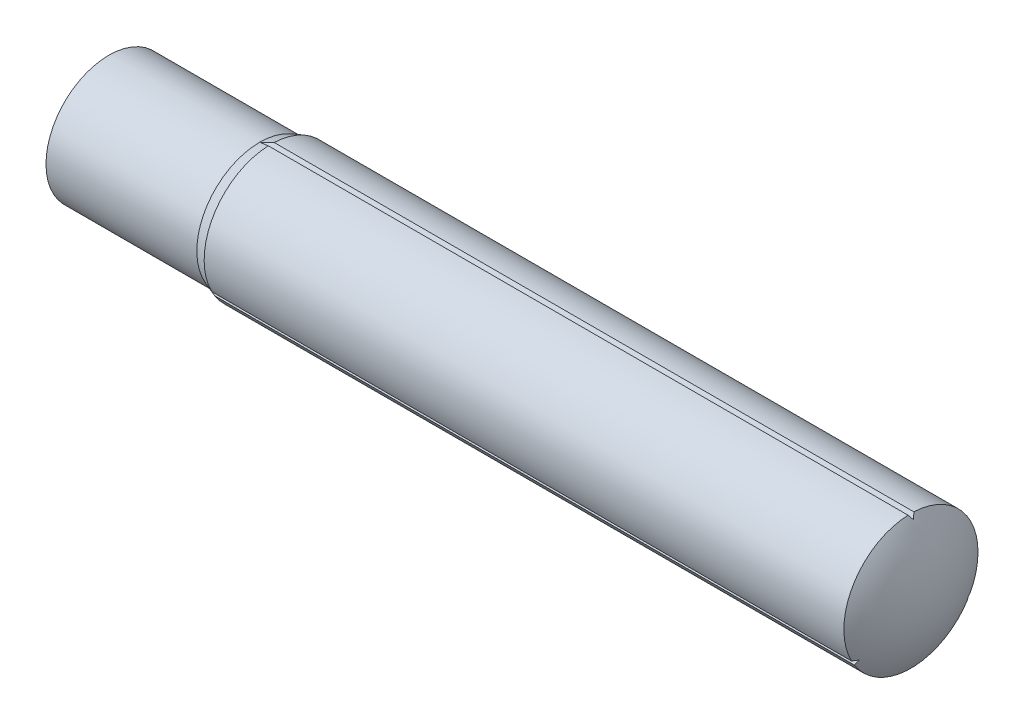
ISO-10303-21;
HEADER;
FILE_DESCRIPTION(('STEP AP214'),'2;1');
FILE_NAME('part.step','',(''),(''),'','','');
FILE_SCHEMA(('AUTOMOTIVE_DESIGN { 1 0 10303 214 1 1 1 1 }'));
ENDSEC;
DATA;
#1=APPLICATION_CONTEXT('core data for automotive mechanical design processes');
#2=APPLICATION_PROTOCOL_DEFINITION('international standard','automotive_design',2000,#1);
#3=PRODUCT_CONTEXT('',#1,'mechanical');
#4=PRODUCT('Part','Part','',(#3));
#5=PRODUCT_RELATED_PRODUCT_CATEGORY('part','',(#4));
#6=PRODUCT_DEFINITION_FORMATION('','',#4);
#7=PRODUCT_DEFINITION_CONTEXT('part definition',#1,'design');
#8=PRODUCT_DEFINITION('design','',#6,#7);
#9=PRODUCT_DEFINITION_SHAPE('','',#8);
#10=(LENGTH_UNIT() NAMED_UNIT(*) SI_UNIT(.MILLI.,.METRE.));
#11=(NAMED_UNIT(*) PLANE_ANGLE_UNIT() SI_UNIT($,.RADIAN.));
#12=(NAMED_UNIT(*) SI_UNIT($,.STERADIAN.) SOLID_ANGLE_UNIT());
#13=UNCERTAINTY_MEASURE_WITH_UNIT(LENGTH_MEASURE(1.E-05),#10,'distance_accuracy_value','');
#14=(GEOMETRIC_REPRESENTATION_CONTEXT(3) GLOBAL_UNCERTAINTY_ASSIGNED_CONTEXT((#13)) GLOBAL_UNIT_ASSIGNED_CONTEXT((#10,
#11,#12)) REPRESENTATION_CONTEXT('',''));
#15=CARTESIAN_POINT('',(0.,0.,0.));
#16=DIRECTION('',(0.,0.,1.));
#17=DIRECTION('',(1.,0.,0.));
#18=AXIS2_PLACEMENT_3D('',#15,#16,#17);
#19=CARTESIAN_POINT('',(8.5,0.,0.));
#20=DIRECTION('',(-1.,0.,0.));
#21=DIRECTION('',(0.,1.,0.));
#22=AXIS2_PLACEMENT_3D('',#19,#20,#21);
#23=SPHERICAL_SURFACE('',#22,1.5);
#24=CARTESIAN_POINT('',(8.5,-0.428545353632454,-0.0374928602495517));
#25=DIRECTION('',(0.,-0.996194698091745,-0.0871557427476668));
#26=DIRECTION('',(0.,0.0871557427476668,-0.996194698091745));
#27=AXIS2_PLACEMENT_3D('',#24,#25,#26);
#28=CIRCLE('',#27,1.43699101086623);
#29=CARTESIAN_POINT('',(9.76885775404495,-0.369759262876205,-0.709420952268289));
#30=VERTEX_POINT('',#29);
#31=CARTESIAN_POINT('',(9.79903810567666,-0.374999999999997,-0.649519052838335));
#32=VERTEX_POINT('',#31);
#33=EDGE_CURVE('E104',#30,#32,#28,.T.);
#34=ORIENTED_EDGE('',*,*,#33,.F.);
#35=CARTESIAN_POINT('',(9.76885775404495,0.,0.));
#36=DIRECTION('',(-1.,0.,0.));
#37=DIRECTION('',(0.,0.,1.));
#38=AXIS2_PLACEMENT_3D('',#35,#36,#37);
#39=CIRCLE('',#38,0.800000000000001);
#40=CARTESIAN_POINT('',(9.76885775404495,0.799256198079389,-0.0344895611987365));
#41=VERTEX_POINT('',#40);
#42=EDGE_CURVE('E206',#41,#30,#39,.T.);
#43=ORIENTED_EDGE('',*,*,#42,.F.);
#44=CARTESIAN_POINT('',(8.5,0.246742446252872,0.352384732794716));
#45=DIRECTION('',(0.,0.573576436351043,0.819152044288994));
#46=DIRECTION('',(0.,-0.819152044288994,0.573576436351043));
#47=AXIS2_PLACEMENT_3D('',#44,#45,#46);
#48=CIRCLE('',#47,1.43699101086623);
#49=CARTESIAN_POINT('',(9.79903810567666,0.750000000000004,0.));
#50=VERTEX_POINT('',#49);
#51=EDGE_CURVE('E184',#50,#41,#48,.T.);
#52=ORIENTED_EDGE('',*,*,#51,.F.);
#53=CARTESIAN_POINT('',(8.5,0.246742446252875,-0.352384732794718));
#54=DIRECTION('',(0.,0.573576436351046,-0.819152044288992));
#55=DIRECTION('',(0.,0.819152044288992,0.573576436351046));
#56=AXIS2_PLACEMENT_3D('',#53,#54,#55);
#57=CIRCLE('',#56,1.43699101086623);
#58=CARTESIAN_POINT('',(9.76885775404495,0.799256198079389,0.0344895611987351));
#59=VERTEX_POINT('',#58);
#60=EDGE_CURVE('E203',#59,#50,#57,.T.);
#61=ORIENTED_EDGE('',*,*,#60,.F.);
#62=CARTESIAN_POINT('',(9.76885775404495,-0.369759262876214,0.709420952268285));
#63=VERTEX_POINT('',#62);
#64=EDGE_CURVE('E205',#63,#59,#39,.T.);
#65=ORIENTED_EDGE('',*,*,#64,.F.);
#66=CARTESIAN_POINT('',(8.5,-0.428545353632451,0.0374928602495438));
#67=DIRECTION('',(0.,-0.996194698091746,0.0871557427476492));
#68=DIRECTION('',(0.,-0.0871557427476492,-0.996194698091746));
#69=AXIS2_PLACEMENT_3D('',#66,#67,#68);
#70=CIRCLE('',#69,1.43699101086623);
#71=CARTESIAN_POINT('',(9.79903810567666,-0.375000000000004,0.649519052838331));
#72=VERTEX_POINT('',#71);
#73=EDGE_CURVE('E54',#72,#63,#70,.T.);
#74=ORIENTED_EDGE('',*,*,#73,.F.);
#75=CARTESIAN_POINT('',(8.5,0.181802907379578,0.389877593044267));
#76=DIRECTION('',(0.,0.422618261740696,0.906307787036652));
#77=DIRECTION('',(0.,-0.906307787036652,0.422618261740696));
#78=AXIS2_PLACEMENT_3D('',#75,#76,#77);
#79=CIRCLE('',#78,1.43699101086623);
#80=CARTESIAN_POINT('',(9.76885775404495,-0.42949693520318,0.674931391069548));
#81=VERTEX_POINT('',#80);
#82=EDGE_CURVE('E173',#81,#72,#79,.T.);
#83=ORIENTED_EDGE('',*,*,#82,.F.);
#84=CARTESIAN_POINT('',(9.76885775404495,-0.429496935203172,-0.674931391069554));
#85=VERTEX_POINT('',#84);
#86=EDGE_CURVE('E123',#85,#81,#39,.T.);
#87=ORIENTED_EDGE('',*,*,#86,.F.);
#88=CARTESIAN_POINT('',(8.5,0.181802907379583,-0.38987759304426));
#89=DIRECTION('',(0.,0.422618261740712,-0.906307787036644));
#90=DIRECTION('',(0.,0.906307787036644,0.422618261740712));
#91=AXIS2_PLACEMENT_3D('',#88,#89,#90);
#92=CIRCLE('',#91,1.43699101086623);
#93=EDGE_CURVE('E46',#32,#85,#92,.T.);
#94=ORIENTED_EDGE('',*,*,#93,.F.);
#95=EDGE_LOOP('',(#34,#43,#52,#61,#65,#74,#83,#87,#94));
#96=FACE_BOUND('',#95,.T.);
#97=ADVANCED_FACE('F32',(#96),#23,.T.);
#98=CARTESIAN_POINT('',(2.13737387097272,0.,0.));
#99=DIRECTION('',(1.,0.,0.));
#100=DIRECTION('',(0.,0.,-1.));
#101=AXIS2_PLACEMENT_3D('',#98,#99,#100);
#102=CONICAL_SURFACE('',#101,0.8,0.349065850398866);
#103=CARTESIAN_POINT('',(1.99979999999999,-0.375007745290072,-0.649430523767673));
#104=CARTESIAN_POINT('',(2.02270901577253,-0.374121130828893,-0.659564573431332));
#105=CARTESIAN_POINT('',(2.04564468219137,-0.373239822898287,-0.669637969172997));
#106=CARTESIAN_POINT('',(2.0915693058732,-0.371487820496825,-0.689663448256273));
#107=CARTESIAN_POINT('',(2.11455826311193,-0.370617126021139,-0.699615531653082));
#108=CARTESIAN_POINT('',(2.13757387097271,-0.369751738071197,-0.709506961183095));
#109=B_SPLINE_CURVE_WITH_KNOTS('',3,(#103,#104,#105,#106,#107,#108),.UNSPECIFIED.,.F.,.F.,(4,2,
4),(0.,0.0751974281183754,0.150394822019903),.UNSPECIFIED.);
#110=CARTESIAN_POINT('',(1.99999999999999,-0.374999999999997,-0.649519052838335));
#111=VERTEX_POINT('',#110);
#112=CARTESIAN_POINT('',(2.13737387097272,-0.369759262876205,-0.709420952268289));
#113=VERTEX_POINT('',#112);
#114=EDGE_CURVE('E114',#111,#113,#109,.T.);
#115=ORIENTED_EDGE('',*,*,#114,.F.);
#116=CARTESIAN_POINT('',(1.99999999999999,0.,0.));
#117=DIRECTION('',(-1.,0.,0.));
#118=DIRECTION('',(0.,0.,1.));
#119=AXIS2_PLACEMENT_3D('',#116,#117,#118);
#120=CIRCLE('',#119,0.750000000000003);
#121=CARTESIAN_POINT('',(1.99999999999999,0.750000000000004,0.));
#122=VERTEX_POINT('',#121);
#123=EDGE_CURVE('E214',#122,#111,#120,.T.);
#124=ORIENTED_EDGE('',*,*,#123,.F.);
#125=CARTESIAN_POINT('',(2.13757387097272,0.799326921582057,-0.0345390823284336));
#126=CARTESIAN_POINT('',(2.11455826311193,0.791193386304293,-0.0288439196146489));
#127=CARTESIAN_POINT('',(2.0915693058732,0.783009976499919,-0.0231138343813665));
#128=CARTESIAN_POINT('',(2.04564468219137,0.766543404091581,-0.0115838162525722));
#129=CARTESIAN_POINT('',(2.02270901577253,0.758260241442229,-0.00578388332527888));
#130=CARTESIAN_POINT('',(1.99979999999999,0.749927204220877,5.09721532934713E-05));
#131=B_SPLINE_CURVE_WITH_KNOTS('',3,(#125,#126,#127,#128,#129,#130),.UNSPECIFIED.,.F.,.F.,(4,2,
4),(0.,0.0751973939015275,0.150394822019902),.UNSPECIFIED.);
#132=CARTESIAN_POINT('',(2.13737387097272,0.799256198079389,-0.0344895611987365));
#133=VERTEX_POINT('',#132);
#134=EDGE_CURVE('E178',#133,#122,#131,.T.);
#135=ORIENTED_EDGE('',*,*,#134,.F.);
#136=CARTESIAN_POINT('',(2.13737387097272,0.,0.));
#137=DIRECTION('',(-1.,0.,0.));
#138=DIRECTION('',(0.,0.,1.));
#139=AXIS2_PLACEMENT_3D('',#136,#137,#138);
#140=CIRCLE('',#139,0.8);
#141=EDGE_CURVE('E209',#133,#113,#140,.T.);
#142=ORIENTED_EDGE('',*,*,#141,.T.);
#143=EDGE_LOOP('',(#115,#124,#135,#142));
#144=FACE_BOUND('',#143,.T.);
#145=ADVANCED_FACE('F139',(#144),#102,.T.);
#146=CARTESIAN_POINT('',(2.13757387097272,-0.429575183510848,-0.674967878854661));
#147=CARTESIAN_POINT('',(2.11455826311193,-0.420576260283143,-0.670771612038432));
#148=CARTESIAN_POINT('',(2.0915693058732,-0.411522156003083,-0.666549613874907));
#149=CARTESIAN_POINT('',(2.04564468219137,-0.393303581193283,-0.658054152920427));
#150=CARTESIAN_POINT('',(2.02270901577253,-0.384139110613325,-0.653780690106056));
#151=CARTESIAN_POINT('',(1.99979999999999,-0.374919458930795,-0.64948149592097));
#152=B_SPLINE_CURVE_WITH_KNOTS('',3,(#146,#147,#148,#149,#150,#151),.UNSPECIFIED.,.F.,.F.,(4,2,
4),(0.,0.0751973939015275,0.150394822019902),.UNSPECIFIED.);
#153=CARTESIAN_POINT('',(2.13737387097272,-0.429496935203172,-0.674931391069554));
#154=VERTEX_POINT('',#153);
#155=EDGE_CURVE('E118',#154,#111,#152,.T.);
#156=ORIENTED_EDGE('',*,*,#155,.F.);
#157=CARTESIAN_POINT('',(2.13737387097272,-0.42949693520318,0.674931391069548));
#158=VERTEX_POINT('',#157);
#159=EDGE_CURVE('E213',#154,#158,#140,.T.);
#160=ORIENTED_EDGE('',*,*,#159,.T.);
#161=CARTESIAN_POINT('',(1.99979999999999,-0.3749194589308,0.649481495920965));
#162=CARTESIAN_POINT('',(2.02270901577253,-0.384139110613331,0.653780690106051));
#163=CARTESIAN_POINT('',(2.04564468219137,-0.39330358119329,0.658054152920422));
#164=CARTESIAN_POINT('',(2.0915693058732,-0.411522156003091,0.666549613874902));
#165=CARTESIAN_POINT('',(2.11455826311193,-0.420576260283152,0.670771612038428));
#166=CARTESIAN_POINT('',(2.13757387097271,-0.429575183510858,0.674967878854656));
#167=B_SPLINE_CURVE_WITH_KNOTS('',3,(#161,#162,#163,#164,#165,#166),.UNSPECIFIED.,.F.,.F.,(4,2,
4),(0.,0.075197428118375,0.150394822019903),.UNSPECIFIED.);
#168=CARTESIAN_POINT('',(1.99999999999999,-0.375000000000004,0.649519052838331));
#169=VERTEX_POINT('',#168);
#170=EDGE_CURVE('E167',#169,#158,#167,.T.);
#171=ORIENTED_EDGE('',*,*,#170,.F.);
#172=EDGE_CURVE('E218',#111,#169,#120,.T.);
#173=ORIENTED_EDGE('',*,*,#172,.F.);
#174=EDGE_LOOP('',(#156,#160,#171,#173));
#175=FACE_BOUND('',#174,.T.);
#176=ADVANCED_FACE('F245',(#175),#102,.T.);
#177=CARTESIAN_POINT('',(-11.1634256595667,0.,0.));
#178=DIRECTION('',(-1.,0.,0.));
#179=DIRECTION('',(0.,0.,1.));
#180=AXIS2_PLACEMENT_3D('',#177,#178,#179);
#181=CYLINDRICAL_SURFACE('',#180,0.8);
#182=DIRECTION('',(-1.,0.,0.));
#183=VECTOR('',#182,1.);
#184=CARTESIAN_POINT('',(-11.1634256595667,-0.369759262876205,-0.709420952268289));
#185=LINE('',#184,#183);
#186=EDGE_CURVE('E109',#113,#30,#185,.F.);
#187=ORIENTED_EDGE('',*,*,#186,.F.);
#188=ORIENTED_EDGE('',*,*,#141,.F.);
#189=DIRECTION('',(-1.,0.,0.));
#190=VECTOR('',#189,1.);
#191=CARTESIAN_POINT('',(-11.1634256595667,0.799256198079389,-0.0344895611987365));
#192=LINE('',#191,#190);
#193=EDGE_CURVE('E39',#41,#133,#192,.T.);
#194=ORIENTED_EDGE('',*,*,#193,.F.);
#195=ORIENTED_EDGE('',*,*,#42,.T.);
#196=EDGE_LOOP('',(#187,#188,#194,#195));
#197=FACE_BOUND('',#196,.T.);
#198=ADVANCED_FACE('F196',(#197),#181,.T.);
#199=DIRECTION('',(-1.,0.,0.));
#200=VECTOR('',#199,1.);
#201=CARTESIAN_POINT('',(-11.1634256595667,-0.429496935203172,-0.674931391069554));
#202=LINE('',#201,#200);
#203=EDGE_CURVE('E119',#85,#154,#202,.T.);
#204=ORIENTED_EDGE('',*,*,#203,.F.);
#205=ORIENTED_EDGE('',*,*,#86,.T.);
#206=DIRECTION('',(-1.,0.,0.));
#207=VECTOR('',#206,1.);
#208=CARTESIAN_POINT('',(-11.1634256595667,-0.42949693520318,0.674931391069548));
#209=LINE('',#208,#207);
#210=EDGE_CURVE('E164',#158,#81,#209,.F.);
#211=ORIENTED_EDGE('',*,*,#210,.F.);
#212=ORIENTED_EDGE('',*,*,#159,.F.);
#213=EDGE_LOOP('',(#204,#205,#211,#212));
#214=FACE_BOUND('',#213,.T.);
#215=ADVANCED_FACE('F237',(#214),#181,.T.);
#216=CARTESIAN_POINT('',(2.13757387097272,-0.369751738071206,0.709506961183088));
#217=CARTESIAN_POINT('',(2.11455826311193,-0.370617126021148,0.699615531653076));
#218=CARTESIAN_POINT('',(2.0915693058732,-0.371487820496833,0.689663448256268));
#219=CARTESIAN_POINT('',(2.04564468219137,-0.373239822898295,0.669637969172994));
#220=CARTESIAN_POINT('',(2.02270901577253,-0.374121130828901,0.65956457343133));
#221=CARTESIAN_POINT('',(1.99979999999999,-0.375007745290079,0.649430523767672));
#222=B_SPLINE_CURVE_WITH_KNOTS('',3,(#216,#217,#218,#219,#220,#221),.UNSPECIFIED.,.F.,.F.,(4,2,
4),(0.,0.0751973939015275,0.150394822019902),.UNSPECIFIED.);
#223=CARTESIAN_POINT('',(2.13737387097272,-0.369759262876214,0.709420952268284));
#224=VERTEX_POINT('',#223);
#225=EDGE_CURVE('E155',#224,#169,#222,.T.);
#226=ORIENTED_EDGE('',*,*,#225,.F.);
#227=CARTESIAN_POINT('',(2.13737387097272,0.799256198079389,0.0344895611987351));
#228=VERTEX_POINT('',#227);
#229=EDGE_CURVE('E208',#224,#228,#140,.T.);
#230=ORIENTED_EDGE('',*,*,#229,.T.);
#231=CARTESIAN_POINT('',(1.99979999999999,0.749927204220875,-5.09721532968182E-05));
#232=CARTESIAN_POINT('',(2.02270901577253,0.758260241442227,0.00578388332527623));
#233=CARTESIAN_POINT('',(2.04564468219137,0.76654340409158,0.0115838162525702));
#234=CARTESIAN_POINT('',(2.0915693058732,0.783009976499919,0.0231138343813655));
#235=CARTESIAN_POINT('',(2.11455826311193,0.791193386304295,0.0288439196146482));
#236=CARTESIAN_POINT('',(2.13757387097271,0.799326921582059,0.0345390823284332));
#237=B_SPLINE_CURVE_WITH_KNOTS('',3,(#231,#232,#233,#234,#235,#236),.UNSPECIFIED.,.F.,.F.,(4,2,
4),(0.,0.0751974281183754,0.150394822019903),.UNSPECIFIED.);
#238=EDGE_CURVE('E197',#122,#228,#237,.T.);
#239=ORIENTED_EDGE('',*,*,#238,.F.);
#240=EDGE_CURVE('E212',#169,#122,#120,.T.);
#241=ORIENTED_EDGE('',*,*,#240,.F.);
#242=EDGE_LOOP('',(#226,#230,#239,#241));
#243=FACE_BOUND('',#242,.T.);
#244=ADVANCED_FACE('F248',(#243),#102,.T.);
#245=DIRECTION('',(-1.,0.,0.));
#246=VECTOR('',#245,1.);
#247=CARTESIAN_POINT('',(-11.1634256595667,-0.369759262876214,0.709420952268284));
#248=LINE('',#247,#246);
#249=EDGE_CURVE('E162',#63,#224,#248,.T.);
#250=ORIENTED_EDGE('',*,*,#249,.F.);
#251=ORIENTED_EDGE('',*,*,#64,.T.);
#252=DIRECTION('',(-1.,0.,0.));
#253=VECTOR('',#252,1.);
#254=CARTESIAN_POINT('',(-11.1634256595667,0.799256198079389,0.0344895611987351));
#255=LINE('',#254,#253);
#256=EDGE_CURVE('E11',#228,#59,#255,.F.);
#257=ORIENTED_EDGE('',*,*,#256,.F.);
#258=ORIENTED_EDGE('',*,*,#229,.F.);
#259=EDGE_LOOP('',(#250,#251,#257,#258));
#260=FACE_BOUND('',#259,.T.);
#261=ADVANCED_FACE('F234',(#260),#181,.T.);
#262=CARTESIAN_POINT('',(1.5,0.,0.));
#263=DIRECTION('',(-1.,0.,0.));
#264=DIRECTION('',(0.,1.,0.));
#265=AXIS2_PLACEMENT_3D('',#262,#263,#264);
#266=SPHERICAL_SURFACE('',#265,1.5);
#267=CARTESIAN_POINT('',(0.200961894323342,0.,0.));
#268=DIRECTION('',(-1.,0.,0.));
#269=DIRECTION('',(0.,0.,1.));
#270=AXIS2_PLACEMENT_3D('',#267,#268,#269);
#271=CIRCLE('',#270,0.750000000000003);
#272=CARTESIAN_POINT('',(0.200961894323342,0.,0.750000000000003));
#273=VERTEX_POINT('',#272);
#274=EDGE_CURVE('E217',#273,#273,#271,.T.);
#275=ORIENTED_EDGE('',*,*,#274,.T.);
#276=EDGE_LOOP('',(#275));
#277=FACE_BOUND('',#276,.T.);
#278=ADVANCED_FACE('F251',(#277),#266,.T.);
#279=CARTESIAN_POINT('',(-11.1634256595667,0.,0.));
#280=DIRECTION('',(-1.,0.,0.));
#281=DIRECTION('',(0.,0.,1.));
#282=AXIS2_PLACEMENT_3D('',#279,#280,#281);
#283=CYLINDRICAL_SURFACE('',#282,0.750000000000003);
#284=ORIENTED_EDGE('',*,*,#274,.F.);
#285=EDGE_LOOP('',(#284));
#286=FACE_BOUND('',#285,.T.);
#287=ORIENTED_EDGE('',*,*,#123,.T.);
#288=ORIENTED_EDGE('',*,*,#172,.T.);
#289=ORIENTED_EDGE('',*,*,#240,.T.);
#290=EDGE_LOOP('',(#287,#288,#289));
#291=FACE_BOUND('',#290,.T.);
#292=ADVANCED_FACE('F194',(#286,#291),#283,.T.);
#293=CARTESIAN_POINT('',(10.,0.8,0.0350103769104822));
#294=DIRECTION('',(0.,0.573576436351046,-0.819152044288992));
#295=DIRECTION('',(0.,0.819152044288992,0.573576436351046));
#296=AXIS2_PLACEMENT_3D('',#293,#294,#295);
#297=PLANE('',#296);
#298=ORIENTED_EDGE('',*,*,#60,.T.);
#299=DIRECTION('',(-1.,0.,0.));
#300=VECTOR('',#299,1.);
#301=CARTESIAN_POINT('',(10.,0.750000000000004,0.));
#302=LINE('',#301,#300);
#303=EDGE_CURVE('E175',#50,#122,#302,.T.);
#304=ORIENTED_EDGE('',*,*,#303,.T.);
#305=ORIENTED_EDGE('',*,*,#238,.T.);
#306=ORIENTED_EDGE('',*,*,#256,.T.);
#307=EDGE_LOOP('',(#298,#304,#305,#306));
#308=FACE_BOUND('',#307,.T.);
#309=ADVANCED_FACE('F190',(#308),#297,.T.);
#310=CARTESIAN_POINT('',(10.,0.750000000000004,0.));
#311=DIRECTION('',(0.,0.573576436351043,0.819152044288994));
#312=DIRECTION('',(0.,-0.819152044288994,0.573576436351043));
#313=AXIS2_PLACEMENT_3D('',#310,#311,#312);
#314=PLANE('',#313);
#315=ORIENTED_EDGE('',*,*,#51,.T.);
#316=ORIENTED_EDGE('',*,*,#193,.T.);
#317=ORIENTED_EDGE('',*,*,#134,.T.);
#318=ORIENTED_EDGE('',*,*,#303,.F.);
#319=EDGE_LOOP('',(#315,#316,#317,#318));
#320=FACE_BOUND('',#319,.T.);
#321=ADVANCED_FACE('F186',(#320),#314,.T.);
#322=CARTESIAN_POINT('',(10.,-0.430319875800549,0.675315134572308));
#323=DIRECTION('',(0.,0.422618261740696,0.906307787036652));
#324=DIRECTION('',(0.,-0.906307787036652,0.422618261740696));
#325=AXIS2_PLACEMENT_3D('',#322,#323,#324);
#326=PLANE('',#325);
#327=ORIENTED_EDGE('',*,*,#82,.T.);
#328=DIRECTION('',(-1.,0.,0.));
#329=VECTOR('',#328,1.);
#330=CARTESIAN_POINT('',(10.,-0.375000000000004,0.649519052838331));
#331=LINE('',#330,#329);
#332=EDGE_CURVE('E113',#72,#169,#331,.T.);
#333=ORIENTED_EDGE('',*,*,#332,.T.);
#334=ORIENTED_EDGE('',*,*,#170,.T.);
#335=ORIENTED_EDGE('',*,*,#210,.T.);
#336=EDGE_LOOP('',(#327,#333,#334,#335));
#337=FACE_BOUND('',#336,.T.);
#338=ADVANCED_FACE('F151',(#337),#326,.T.);
#339=CARTESIAN_POINT('',(10.,-0.375000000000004,0.649519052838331));
#340=DIRECTION('',(0.,-0.996194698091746,0.0871557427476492));
#341=DIRECTION('',(0.,-0.0871557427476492,-0.996194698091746));
#342=AXIS2_PLACEMENT_3D('',#339,#340,#341);
#343=PLANE('',#342);
#344=ORIENTED_EDGE('',*,*,#73,.T.);
#345=ORIENTED_EDGE('',*,*,#249,.T.);
#346=ORIENTED_EDGE('',*,*,#225,.T.);
#347=ORIENTED_EDGE('',*,*,#332,.F.);
#348=EDGE_LOOP('',(#344,#345,#346,#347));
#349=FACE_BOUND('',#348,.T.);
#350=ADVANCED_FACE('F146',(#349),#343,.T.);
#351=CARTESIAN_POINT('',(10.,-0.369680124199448,-0.710325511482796));
#352=DIRECTION('',(0.,-0.996194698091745,-0.0871557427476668));
#353=DIRECTION('',(0.,0.0871557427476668,-0.996194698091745));
#354=AXIS2_PLACEMENT_3D('',#351,#352,#353);
#355=PLANE('',#354);
#356=ORIENTED_EDGE('',*,*,#33,.T.);
#357=DIRECTION('',(-1.,0.,0.));
#358=VECTOR('',#357,1.);
#359=CARTESIAN_POINT('',(10.,-0.374999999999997,-0.649519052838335));
#360=LINE('',#359,#358);
#361=EDGE_CURVE('E106',#32,#111,#360,.T.);
#362=ORIENTED_EDGE('',*,*,#361,.T.);
#363=ORIENTED_EDGE('',*,*,#114,.T.);
#364=ORIENTED_EDGE('',*,*,#186,.T.);
#365=EDGE_LOOP('',(#356,#362,#363,#364));
#366=FACE_BOUND('',#365,.T.);
#367=ADVANCED_FACE('F105',(#366),#355,.T.);
#368=CARTESIAN_POINT('',(10.,-0.374999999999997,-0.649519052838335));
#369=DIRECTION('',(0.,0.422618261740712,-0.906307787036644));
#370=DIRECTION('',(0.,0.906307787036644,0.422618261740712));
#371=AXIS2_PLACEMENT_3D('',#368,#369,#370);
#372=PLANE('',#371);
#373=ORIENTED_EDGE('',*,*,#93,.T.);
#374=ORIENTED_EDGE('',*,*,#203,.T.);
#375=ORIENTED_EDGE('',*,*,#155,.T.);
#376=ORIENTED_EDGE('',*,*,#361,.F.);
#377=EDGE_LOOP('',(#373,#374,#375,#376));
#378=FACE_BOUND('',#377,.T.);
#379=ADVANCED_FACE('F116',(#378),#372,.T.);
#380=CLOSED_SHELL('',(#97,#145,#176,#198,#215,#244,#261,#278,#292,#309,#321,#338,#350,#367,#379));
#381=MANIFOLD_SOLID_BREP('B2',#380);
#382=ADVANCED_BREP_SHAPE_REPRESENTATION('',(#18,#381),#14);
#383=SHAPE_DEFINITION_REPRESENTATION(#9,#382);
ENDSEC;
END-ISO-10303-21;
